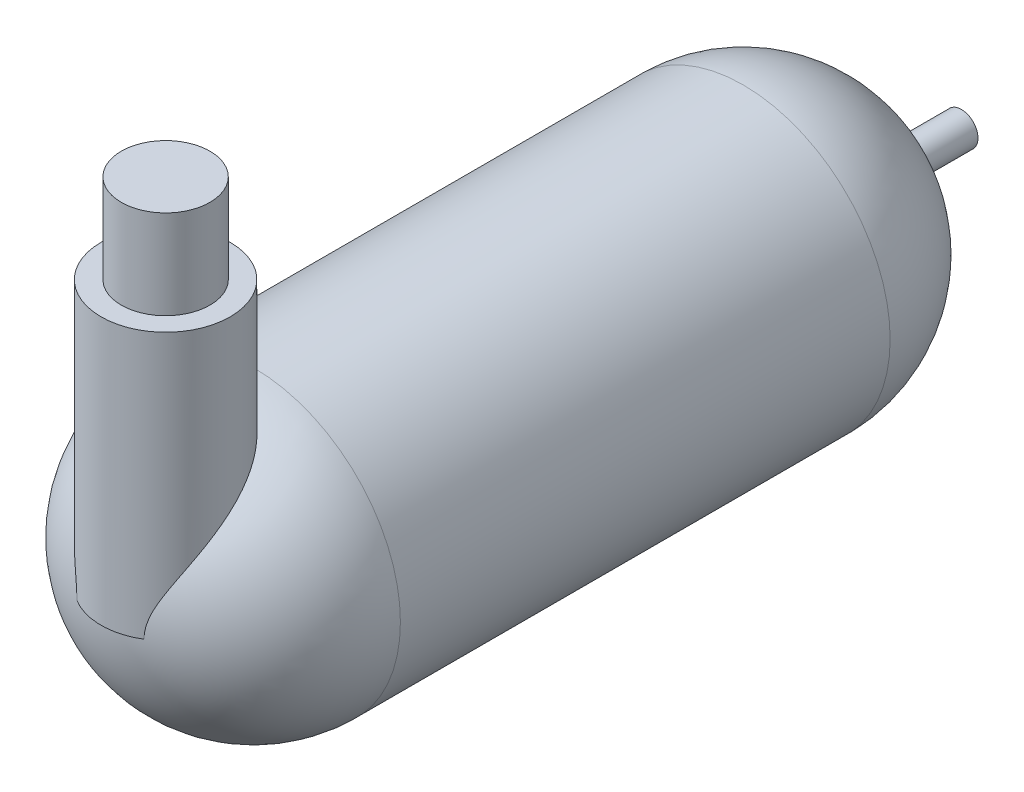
ISO-10303-21;
HEADER;
FILE_DESCRIPTION(('STEP AP214'),'2;1');
FILE_NAME('part.step','',(''),(''),'','','');
FILE_SCHEMA(('AUTOMOTIVE_DESIGN { 1 0 10303 214 1 1 1 1 }'));
ENDSEC;
DATA;
#1=APPLICATION_CONTEXT('core data for automotive mechanical design processes');
#2=APPLICATION_PROTOCOL_DEFINITION('international standard','automotive_design',2000,#1);
#3=PRODUCT_CONTEXT('',#1,'mechanical');
#4=PRODUCT('Part','Part','',(#3));
#5=PRODUCT_RELATED_PRODUCT_CATEGORY('part','',(#4));
#6=PRODUCT_DEFINITION_FORMATION('','',#4);
#7=PRODUCT_DEFINITION_CONTEXT('part definition',#1,'design');
#8=PRODUCT_DEFINITION('design','',#6,#7);
#9=PRODUCT_DEFINITION_SHAPE('','',#8);
#10=(LENGTH_UNIT() NAMED_UNIT(*) SI_UNIT(.MILLI.,.METRE.));
#11=(NAMED_UNIT(*) PLANE_ANGLE_UNIT() SI_UNIT($,.RADIAN.));
#12=(NAMED_UNIT(*) SI_UNIT($,.STERADIAN.) SOLID_ANGLE_UNIT());
#13=UNCERTAINTY_MEASURE_WITH_UNIT(LENGTH_MEASURE(1.E-05),#10,'distance_accuracy_value','');
#14=(GEOMETRIC_REPRESENTATION_CONTEXT(3) GLOBAL_UNCERTAINTY_ASSIGNED_CONTEXT((#13)) GLOBAL_UNIT_ASSIGNED_CONTEXT((#10,
#11,#12)) REPRESENTATION_CONTEXT('',''));
#15=CARTESIAN_POINT('',(0.,0.,0.));
#16=DIRECTION('',(0.,0.,1.));
#17=DIRECTION('',(1.,0.,0.));
#18=AXIS2_PLACEMENT_3D('',#15,#16,#17);
#19=CARTESIAN_POINT('',(0.,0.,-30.48));
#20=DIRECTION('',(0.,0.,1.));
#21=DIRECTION('',(1.,0.,0.));
#22=AXIS2_PLACEMENT_3D('',#19,#20,#21);
#23=PLANE('',#22);
#24=CARTESIAN_POINT('',(0.,0.,-30.48));
#25=DIRECTION('',(0.,0.,1.));
#26=DIRECTION('',(1.,0.,0.));
#27=AXIS2_PLACEMENT_3D('',#24,#25,#26);
#28=CIRCLE('',#27,25.4);
#29=CARTESIAN_POINT('',(25.4,0.,-30.48));
#30=VERTEX_POINT('',#29);
#31=EDGE_CURVE('E109',#30,#30,#28,.T.);
#32=ORIENTED_EDGE('',*,*,#31,.F.);
#33=EDGE_LOOP('',(#32));
#34=FACE_BOUND('',#33,.T.);
#35=CARTESIAN_POINT('',(0.,0.,-30.48));
#36=DIRECTION('',(0.,0.,1.));
#37=DIRECTION('',(1.,0.,0.));
#38=AXIS2_PLACEMENT_3D('',#35,#36,#37);
#39=CIRCLE('',#38,4.7371);
#40=CARTESIAN_POINT('',(4.7371,0.,-30.48));
#41=VERTEX_POINT('',#40);
#42=EDGE_CURVE('E11',#41,#41,#39,.F.);
#43=ORIENTED_EDGE('',*,*,#42,.F.);
#44=EDGE_LOOP('',(#43));
#45=FACE_BOUND('',#44,.T.);
#46=ADVANCED_FACE('F33',(#34,#45),#23,.F.);
#47=CARTESIAN_POINT('',(0.,76.2,164.769496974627));
#48=DIRECTION('',(0.,1.,0.));
#49=DIRECTION('',(0.,0.,1.));
#50=AXIS2_PLACEMENT_3D('',#47,#48,#49);
#51=PLANE('',#50);
#52=CARTESIAN_POINT('',(0.,76.2,164.769496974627));
#53=DIRECTION('',(0.,1.,0.));
#54=DIRECTION('',(0.,0.,1.));
#55=AXIS2_PLACEMENT_3D('',#52,#53,#54);
#56=CIRCLE('',#55,18.415);
#57=CARTESIAN_POINT('',(0.,76.2,183.184496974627));
#58=VERTEX_POINT('',#57);
#59=EDGE_CURVE('E59',#58,#58,#56,.T.);
#60=ORIENTED_EDGE('',*,*,#59,.T.);
#61=EDGE_LOOP('',(#60));
#62=FACE_BOUND('',#61,.T.);
#63=CARTESIAN_POINT('',(0.,76.2,164.769496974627));
#64=DIRECTION('',(0.,1.,0.));
#65=DIRECTION('',(0.,0.,1.));
#66=AXIS2_PLACEMENT_3D('',#63,#64,#65);
#67=CIRCLE('',#66,12.6476533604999);
#68=CARTESIAN_POINT('',(0.,76.2,177.417150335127));
#69=VERTEX_POINT('',#68);
#70=EDGE_CURVE('E116',#69,#69,#67,.T.);
#71=ORIENTED_EDGE('',*,*,#70,.F.);
#72=EDGE_LOOP('',(#71));
#73=FACE_BOUND('',#72,.T.);
#74=ADVANCED_FACE('F79',(#62,#73),#51,.T.);
#75=CARTESIAN_POINT('',(0.,0.,139.7));
#76=DIRECTION('',(0.,0.,-1.));
#77=DIRECTION('',(0.,1.,0.));
#78=AXIS2_PLACEMENT_3D('',#75,#76,#77);
#79=SPHERICAL_SURFACE('',#78,41.91);
#80=CARTESIAN_POINT('',(0.,0.,139.7));
#81=DIRECTION('',(0.,0.,1.));
#82=DIRECTION('',(1.,0.,0.));
#83=AXIS2_PLACEMENT_3D('',#80,#81,#82);
#84=CIRCLE('',#83,41.91);
#85=CARTESIAN_POINT('',(41.91,0.,139.7));
#86=VERTEX_POINT('',#85);
#87=EDGE_CURVE('E54',#86,#86,#84,.T.);
#88=ORIENTED_EDGE('',*,*,#87,.T.);
#89=EDGE_LOOP('',(#88));
#90=FACE_BOUND('',#89,.T.);
#91=CARTESIAN_POINT('',(0.,0.,139.7));
#92=DIRECTION('',(0.,1.,0.));
#93=DIRECTION('',(0.,0.,1.));
#94=AXIS2_PLACEMENT_3D('',#91,#92,#93);
#95=CIRCLE('',#94,41.91);
#96=CARTESIAN_POINT('',(9.56936559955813,0.,180.502883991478));
#97=VERTEX_POINT('',#96);
#98=CARTESIAN_POINT('',(-9.56936559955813,0.,180.502883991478));
#99=VERTEX_POINT('',#98);
#100=EDGE_CURVE('E50',#97,#99,#95,.F.);
#101=ORIENTED_EDGE('',*,*,#100,.T.);
#102=CARTESIAN_POINT('',(-9.56936560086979,-0.0002,180.50288399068));
#103=CARTESIAN_POINT('',(-9.56928423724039,0.267626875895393,180.502907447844));
#104=CARTESIAN_POINT('',(-9.57641319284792,0.535421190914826,180.498597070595));
#105=CARTESIAN_POINT('',(-9.60450601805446,1.06987708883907,180.48147252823));
#106=CARTESIAN_POINT('',(-9.62546275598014,1.3365391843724,180.468662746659));
#107=CARTESIAN_POINT('',(-9.68049088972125,1.86663432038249,180.434786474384));
#108=CARTESIAN_POINT('',(-9.7144972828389,2.13007679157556,180.413760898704));
#109=CARTESIAN_POINT('',(-9.79460172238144,2.65435026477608,180.363734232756));
#110=CARTESIAN_POINT('',(-9.84070114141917,2.91518096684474,180.334732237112));
#111=CARTESIAN_POINT('',(-9.99340912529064,3.68318524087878,180.237477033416));
#112=CARTESIAN_POINT('',(-10.1155636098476,4.18594332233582,180.158304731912));
#113=CARTESIAN_POINT('',(-10.3918770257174,5.17794321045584,179.973070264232));
#114=CARTESIAN_POINT('',(-10.5460815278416,5.66716463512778,179.866969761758));
#115=CARTESIAN_POINT('',(-10.8501679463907,6.55362026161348,179.649523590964));
#116=CARTESIAN_POINT('',(-10.9967053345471,6.95292040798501,179.541810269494));
#117=CARTESIAN_POINT('',(-11.3009635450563,7.74257187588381,179.310369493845));
#118=CARTESIAN_POINT('',(-11.4586867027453,8.13292130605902,179.186638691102));
#119=CARTESIAN_POINT('',(-11.7814820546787,8.90555618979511,178.924080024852));
#120=CARTESIAN_POINT('',(-11.9465568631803,9.28783870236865,178.785246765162));
#121=CARTESIAN_POINT('',(-12.2808366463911,10.0450121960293,178.493291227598));
#122=CARTESIAN_POINT('',(-12.4500413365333,10.4199036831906,178.340169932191));
#123=CARTESIAN_POINT('',(-12.7918155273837,11.1670574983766,178.018547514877));
#124=CARTESIAN_POINT('',(-12.9644016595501,11.5392487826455,177.849899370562));
#125=CARTESIAN_POINT('',(-13.308927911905,12.2775582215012,177.499190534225));
#126=CARTESIAN_POINT('',(-13.4808680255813,12.6436763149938,177.317129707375));
#127=CARTESIAN_POINT('',(-13.8221699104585,13.3702835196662,176.940137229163));
#128=CARTESIAN_POINT('',(-13.9915324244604,13.7307742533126,176.745209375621));
#129=CARTESIAN_POINT('',(-14.3261147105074,14.4466842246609,176.342877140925));
#130=CARTESIAN_POINT('',(-14.4913344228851,14.8021033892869,176.135472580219));
#131=CARTESIAN_POINT('',(-14.8374938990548,15.5544842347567,175.680638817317));
#132=CARTESIAN_POINT('',(-15.0176568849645,15.9507871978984,175.431526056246));
#133=CARTESIAN_POINT('',(-15.3690341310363,16.7377295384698,174.918472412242));
#134=CARTESIAN_POINT('',(-15.5402482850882,17.1283688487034,174.654531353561));
#135=CARTESIAN_POINT('',(-15.8721119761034,17.9043110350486,174.112372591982));
#136=CARTESIAN_POINT('',(-16.0327596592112,18.2896129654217,173.834152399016));
#137=CARTESIAN_POINT('',(-16.3419424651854,19.0549671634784,173.264100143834));
#138=CARTESIAN_POINT('',(-16.4904777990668,19.4350195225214,172.972268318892));
#139=CARTESIAN_POINT('',(-16.7735648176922,20.188731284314,172.376607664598));
#140=CARTESIAN_POINT('',(-16.9081605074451,20.5624074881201,172.072821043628));
#141=CARTESIAN_POINT('',(-17.1625856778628,21.3046126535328,171.453065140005));
#142=CARTESIAN_POINT('',(-17.2824161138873,21.6731419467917,171.137096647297));
#143=CARTESIAN_POINT('',(-17.5060243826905,22.4049301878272,170.493766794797));
#144=CARTESIAN_POINT('',(-17.609806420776,22.7681904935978,170.166408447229));
#145=CARTESIAN_POINT('',(-17.8001527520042,23.4894915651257,169.500946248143));
#146=CARTESIAN_POINT('',(-17.8867127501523,23.8475310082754,169.16283974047));
#147=CARTESIAN_POINT('',(-18.0946987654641,24.8030499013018,168.240348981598));
#148=CARTESIAN_POINT('',(-18.199052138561,25.3955241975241,167.64679468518));
#149=CARTESIAN_POINT('',(-18.3495515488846,26.5636495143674,166.436257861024));
#150=CARTESIAN_POINT('',(-18.3957085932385,27.1393036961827,165.819279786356));
#151=CARTESIAN_POINT('',(-18.4173293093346,27.9889195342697,164.880326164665));
#152=CARTESIAN_POINT('',(-18.4165977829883,28.2698431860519,164.565059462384));
#153=CARTESIAN_POINT('',(-18.3986271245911,28.8268074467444,163.930806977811));
#154=CARTESIAN_POINT('',(-18.3813905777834,29.1028488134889,163.61182178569));
#155=CARTESIAN_POINT('',(-18.3039608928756,29.9232734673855,162.650442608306));
#156=CARTESIAN_POINT('',(-18.2180534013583,30.4601472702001,162.003414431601));
#157=CARTESIAN_POINT('',(-17.9958528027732,31.4126832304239,160.82610293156));
#158=CARTESIAN_POINT('',(-17.8719733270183,31.8322501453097,160.296595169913));
#159=CARTESIAN_POINT('',(-17.5734438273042,32.6546640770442,159.23883427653));
#160=CARTESIAN_POINT('',(-17.3987965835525,33.0575120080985,158.710581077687));
#161=CARTESIAN_POINT('',(-16.9968282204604,33.8443656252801,157.660653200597));
#162=CARTESIAN_POINT('',(-16.7695513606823,34.228386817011,157.138973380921));
#163=CARTESIAN_POINT('',(-16.3880218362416,34.788799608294,156.365470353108));
#164=CARTESIAN_POINT('',(-16.254079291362,34.9729972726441,156.109143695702));
#165=CARTESIAN_POINT('',(-15.9724543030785,35.335997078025,155.600115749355));
#166=CARTESIAN_POINT('',(-15.8247683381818,35.5147978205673,155.347415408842));
#167=CARTESIAN_POINT('',(-15.4134149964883,35.9828909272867,154.681003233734));
#168=CARTESIAN_POINT('',(-15.1375712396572,36.2671596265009,154.271186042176));
#169=CARTESIAN_POINT('',(-14.5476154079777,36.8182813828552,153.467840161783));
#170=CARTESIAN_POINT('',(-14.2335102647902,37.085137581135,153.074308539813));
#171=CARTESIAN_POINT('',(-13.5672003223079,37.5999230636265,152.307504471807));
#172=CARTESIAN_POINT('',(-13.2149938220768,37.847851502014,151.934232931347));
#173=CARTESIAN_POINT('',(-12.4732805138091,38.3230527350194,151.212310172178));
#174=CARTESIAN_POINT('',(-12.0837730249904,38.5503251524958,150.863659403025));
#175=CARTESIAN_POINT('',(-11.2658171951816,38.9840530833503,150.192961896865));
#176=CARTESIAN_POINT('',(-10.8370978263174,39.1903390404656,149.87113514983));
#177=CARTESIAN_POINT('',(-9.94544483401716,39.5782698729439,149.261694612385));
#178=CARTESIAN_POINT('',(-9.48251018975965,39.7599140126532,148.974081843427));
#179=CARTESIAN_POINT('',(-8.52579635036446,40.0966107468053,148.437823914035));
#180=CARTESIAN_POINT('',(-8.03203632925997,40.2516796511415,148.189154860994));
#181=CARTESIAN_POINT('',(-7.01739381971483,40.5336060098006,147.734908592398));
#182=CARTESIAN_POINT('',(-6.49651613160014,40.6604684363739,147.529323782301));
#183=CARTESIAN_POINT('',(-5.5035754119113,40.8694844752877,147.189384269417));
#184=CARTESIAN_POINT('',(-5.03428463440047,40.9553464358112,147.049183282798));
#185=CARTESIAN_POINT('',(-4.08256942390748,41.1039129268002,146.806034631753));
#186=CARTESIAN_POINT('',(-3.60014622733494,41.1666196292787,146.70308347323));
#187=CARTESIAN_POINT('',(-2.62641851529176,41.2682047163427,146.53606486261));
#188=CARTESIAN_POINT('',(-2.13511908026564,41.3070963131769,146.471975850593));
#189=CARTESIAN_POINT('',(-1.1476474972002,41.36069077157,146.383611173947));
#190=CARTESIAN_POINT('',(-0.65147563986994,41.3753950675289,146.359333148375));
#191=CARTESIAN_POINT('',(0.295249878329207,41.3802282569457,146.351355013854));
#192=CARTESIAN_POINT('',(0.74576780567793,41.3725093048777,146.364101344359));
#193=CARTESIAN_POINT('',(1.64385030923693,41.3371099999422,146.422496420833));
#194=CARTESIAN_POINT('',(2.09141511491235,41.3094312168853,146.46814257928));
#195=CARTESIAN_POINT('',(2.9803092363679,41.2343630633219,146.591727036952));
#196=CARTESIAN_POINT('',(3.42163946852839,41.1869766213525,146.669660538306));
#197=CARTESIAN_POINT('',(4.29507022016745,41.0729006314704,146.856817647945));
#198=CARTESIAN_POINT('',(4.7271705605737,41.0062107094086,146.96604186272));
#199=CARTESIAN_POINT('',(5.57604415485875,40.8546595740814,147.213474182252));
#200=CARTESIAN_POINT('',(5.99290885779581,40.7699401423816,147.351455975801));
#201=CARTESIAN_POINT('',(6.81221344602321,40.5826962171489,147.655266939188));
#202=CARTESIAN_POINT('',(7.21465356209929,40.4801720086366,147.82109566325));
#203=CARTESIAN_POINT('',(8.0029553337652,40.2580550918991,148.178767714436));
#204=CARTESIAN_POINT('',(8.38881507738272,40.1384604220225,148.370614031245));
#205=CARTESIAN_POINT('',(9.14203402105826,39.8830260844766,148.778285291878));
#206=CARTESIAN_POINT('',(9.50939245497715,39.7471857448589,148.994111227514));
#207=CARTESIAN_POINT('',(10.2479606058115,39.4505095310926,149.462786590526));
#208=CARTESIAN_POINT('',(10.6177838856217,39.2886094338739,149.717146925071));
#209=CARTESIAN_POINT('',(11.3330911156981,38.9483583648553,150.24807508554));
#210=CARTESIAN_POINT('',(11.6785741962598,38.7700068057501,150.524643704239));
#211=CARTESIAN_POINT('',(12.3441582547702,38.3978776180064,151.097380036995));
#212=CARTESIAN_POINT('',(12.6642538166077,38.2040967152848,151.393551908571));
#213=CARTESIAN_POINT('',(13.2782493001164,37.8021656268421,152.002844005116));
#214=CARTESIAN_POINT('',(13.5721459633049,37.59401365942,152.315966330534));
#215=CARTESIAN_POINT('',(14.1681942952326,37.1376004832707,152.996487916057));
#216=CARTESIAN_POINT('',(14.4668200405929,36.8875717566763,153.365791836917));
#217=CARTESIAN_POINT('',(15.0300867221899,36.3719747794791,154.119145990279));
#218=CARTESIAN_POINT('',(15.2947252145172,36.1064054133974,154.503197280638));
#219=CARTESIAN_POINT('',(15.7902041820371,35.5609046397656,155.282921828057));
#220=CARTESIAN_POINT('',(16.021033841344,35.2809686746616,155.678598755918));
#221=CARTESIAN_POINT('',(16.4492232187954,34.7079534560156,156.478470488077));
#222=CARTESIAN_POINT('',(16.646579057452,34.4148726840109,156.882666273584));
#223=CARTESIAN_POINT('',(17.0385133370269,33.7669268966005,157.764419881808));
#224=CARTESIAN_POINT('',(17.2271833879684,33.4098865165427,158.243009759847));
#225=CARTESIAN_POINT('',(17.5611905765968,32.6809019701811,159.203923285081));
#226=CARTESIAN_POINT('',(17.7065235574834,32.3089563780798,159.686247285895));
#227=CARTESIAN_POINT('',(17.9554910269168,31.5513886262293,160.651137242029));
#228=CARTESIAN_POINT('',(18.0591117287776,31.1657619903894,161.133703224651));
#229=CARTESIAN_POINT('',(18.2263930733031,30.3820949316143,162.095691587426));
#230=CARTESIAN_POINT('',(18.2900488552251,29.984053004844,162.575113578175));
#231=CARTESIAN_POINT('',(18.3879333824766,29.098691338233,163.619778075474));
#232=CARTESIAN_POINT('',(18.4141180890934,28.6089599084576,164.183737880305));
#233=CARTESIAN_POINT('',(18.4158383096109,27.6147692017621,165.298584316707));
#234=CARTESIAN_POINT('',(18.3913681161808,27.1103082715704,165.849469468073));
#235=CARTESIAN_POINT('',(18.2954069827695,26.0877355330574,166.934433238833));
#236=CARTESIAN_POINT('',(18.2239033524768,25.5696200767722,167.468507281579));
#237=CARTESIAN_POINT('',(18.0376434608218,24.5207664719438,168.516347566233));
#238=CARTESIAN_POINT('',(17.9228822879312,23.9900268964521,169.030111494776));
#239=CARTESIAN_POINT('',(17.6261980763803,22.8056025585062,170.138175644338));
#240=CARTESIAN_POINT('',(17.4352947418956,22.1491861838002,170.727164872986));
#241=CARTESIAN_POINT('',(17.0033671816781,20.8196049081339,171.866616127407));
#242=CARTESIAN_POINT('',(16.7623348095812,20.1464373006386,172.417071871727));
#243=CARTESIAN_POINT('',(16.2375029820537,18.7824631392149,173.476114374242));
#244=CARTESIAN_POINT('',(15.9536480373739,18.0916346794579,173.98464546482));
#245=CARTESIAN_POINT('',(15.5025548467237,17.042386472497,174.712567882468));
#246=CARTESIAN_POINT('',(15.3479703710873,16.690466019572,174.949398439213));
#247=CARTESIAN_POINT('',(15.0315672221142,15.9820318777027,175.411041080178));
#248=CARTESIAN_POINT('',(14.8697489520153,15.6255184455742,175.635853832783));
#249=CARTESIAN_POINT('',(14.5422672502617,14.9121360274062,176.070282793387));
#250=CARTESIAN_POINT('',(14.3766775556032,14.555327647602,176.280054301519));
#251=CARTESIAN_POINT('',(14.0411669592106,13.8366411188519,176.687021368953));
#252=CARTESIAN_POINT('',(13.8712463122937,13.4747632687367,176.884217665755));
#253=CARTESIAN_POINT('',(13.5285954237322,12.7452836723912,177.26570013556));
#254=CARTESIAN_POINT('',(13.3558637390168,12.3776789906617,177.449979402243));
#255=CARTESIAN_POINT('',(13.0095656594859,11.6363859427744,177.805021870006));
#256=CARTESIAN_POINT('',(12.8359992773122,11.2626976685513,177.97578527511));
#257=CARTESIAN_POINT('',(12.4905012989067,10.5090905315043,178.303015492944));
#258=CARTESIAN_POINT('',(12.3185677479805,10.1291811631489,178.45950206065));
#259=CARTESIAN_POINT('',(11.9787461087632,9.3618032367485,178.757812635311));
#260=CARTESIAN_POINT('',(11.8108583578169,8.97433405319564,178.8996354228));
#261=CARTESIAN_POINT('',(11.48256063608,8.19137005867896,179.167687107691));
#262=CARTESIAN_POINT('',(11.3221436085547,7.79588334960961,179.293930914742));
#263=CARTESIAN_POINT('',(11.0126389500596,6.99574237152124,179.529980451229));
#264=CARTESIAN_POINT('',(10.8635484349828,6.59109047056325,179.639790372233));
#265=CARTESIAN_POINT('',(10.580390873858,5.76861383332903,179.842589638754));
#266=CARTESIAN_POINT('',(10.4464497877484,5.35071108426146,179.935441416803));
#267=CARTESIAN_POINT('',(10.2007625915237,4.50446465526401,180.101774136));
#268=CARTESIAN_POINT('',(10.0890188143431,4.07611988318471,180.175253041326));
#269=CARTESIAN_POINT('',(9.89463029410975,3.21202555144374,180.300816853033));
#270=CARTESIAN_POINT('',(9.8118394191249,2.77632516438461,180.353009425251));
#271=CARTESIAN_POINT('',(9.68059832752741,1.89785279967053,180.434884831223));
#272=CARTESIAN_POINT('',(9.63211721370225,1.45508755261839,180.46458791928));
#273=CARTESIAN_POINT('',(9.59169140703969,0.842677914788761,180.489286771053));
#274=CARTESIAN_POINT('',(9.5833367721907,0.674388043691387,180.494379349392));
#275=CARTESIAN_POINT('',(9.57216705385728,0.337340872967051,180.50118105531));
#276=CARTESIAN_POINT('',(9.56935907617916,0.168583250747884,180.502885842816));
#277=CARTESIAN_POINT('',(9.56936560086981,-0.000200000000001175,180.50288399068));
#278=B_SPLINE_CURVE_WITH_KNOTS('',3,(#102,#103,#104,#105,#106,#107,#108,#109,#110,#111,#112,
#113,#114,#115,#116,#117,#118,#119,#120,#121,#122,#123,#124,#125,#126,#127,#128,#129,#130,#131,
#132,#133,#134,#135,#136,#137,#138,#139,#140,#141,#142,#143,#144,#145,#146,#147,#148,#149,#150,
#151,#152,#153,#154,#155,#156,#157,#158,#159,#160,#161,#162,#163,#164,#165,#166,#167,#168,#169,
#170,#171,#172,#173,#174,#175,#176,#177,#178,#179,#180,#181,#182,#183,#184,#185,#186,#187,#188,
#189,#190,#191,#192,#193,#194,#195,#196,#197,#198,#199,#200,#201,#202,#203,#204,#205,#206,#207,
#208,#209,#210,#211,#212,#213,#214,#215,#216,#217,#218,#219,#220,#221,#222,#223,#224,#225,#226,
#227,#228,#229,#230,#231,#232,#233,#234,#235,#236,#237,#238,#239,#240,#241,#242,#243,#244,#245,
#246,#247,#248,#249,#250,#251,#252,#253,#254,#255,#256,#257,#258,#259,#260,#261,#262,#263,#264,
#265,#266,#267,#268,#269,#270,#271,#272,#273,#274,#275,#276,#277),.UNSPECIFIED.,.F.,.F.,(4,2,2,
2,2,2,2,2,2,2,2,2,2,2,2,2,2,2,2,2,2,2,2,2,2,2,2,2,2,2,2,2,2,2,2,2,2,2,2,2,2,2,2,2,2,2,2,2,2,2,2,
2,2,2,2,2,2,2,2,2,2,2,2,2,2,2,2,2,2,2,2,2,2,2,2,2,2,2,2,2,2,2,2,2,2,2,2,4),(0.,
0.803297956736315,1.60618193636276,2.40511745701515,3.2041436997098,4.77187422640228,
6.34184929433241,7.65756257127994,8.97355135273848,10.2900118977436,11.6063819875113,
12.9368360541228,14.26730349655,15.5973799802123,16.9274756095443,18.4318508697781,
19.9362439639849,21.4409002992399,22.9455304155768,24.4452557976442,25.9448840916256,
27.4441187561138,28.9437268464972,31.4766267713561,34.0090475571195,35.2755286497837,
36.5418114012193,39.0735285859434,41.1322006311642,43.1907599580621,45.2475943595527,
46.275971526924,47.304612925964,49.0126697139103,50.720417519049,52.4282415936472,
54.1360968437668,55.8568064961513,57.5775675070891,59.2972686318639,61.0166663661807,
62.5064140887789,63.9960220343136,65.4848028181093,66.9734953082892,68.3241605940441,
69.6747196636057,71.0250781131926,72.375462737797,73.7155965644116,75.0557089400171,
76.3959754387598,77.7362973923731,79.1662849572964,80.5963235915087,82.026666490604,
83.4571870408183,85.0657677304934,86.6744640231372,88.2836738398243,89.8930700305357,
91.7698380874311,93.6467861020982,95.5243539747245,97.4021501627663,99.6421351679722,
101.882372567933,104.12321466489,106.364311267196,109.06876721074,111.77366299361,
114.482094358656,115.836336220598,117.190502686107,118.527675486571,119.864769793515,
121.202573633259,122.540357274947,123.876260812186,125.212275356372,126.547001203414,
127.881386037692,129.226156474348,130.571068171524,131.909090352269,133.245906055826,
133.751526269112,134.257793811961),.UNSPECIFIED.);
#279=EDGE_CURVE('E41',#99,#97,#278,.T.);
#280=ORIENTED_EDGE('',*,*,#279,.T.);
#281=EDGE_LOOP('',(#101,#280));
#282=FACE_BOUND('',#281,.T.);
#283=ADVANCED_FACE('F62',(#90,#282),#79,.T.);
#284=CARTESIAN_POINT('',(0.,0.,139.7));
#285=DIRECTION('',(0.,0.,-1.));
#286=DIRECTION('',(-1.,0.,0.));
#287=AXIS2_PLACEMENT_3D('',#284,#285,#286);
#288=CYLINDRICAL_SURFACE('',#287,41.91);
#289=ORIENTED_EDGE('',*,*,#87,.F.);
#290=EDGE_LOOP('',(#289));
#291=FACE_BOUND('',#290,.T.);
#292=CARTESIAN_POINT('',(0.,0.,0.));
#293=DIRECTION('',(0.,0.,-1.));
#294=DIRECTION('',(-1.,0.,0.));
#295=AXIS2_PLACEMENT_3D('',#292,#293,#294);
#296=CIRCLE('',#295,41.91);
#297=CARTESIAN_POINT('',(-41.91,0.,0.));
#298=VERTEX_POINT('',#297);
#299=EDGE_CURVE('E120',#298,#298,#296,.T.);
#300=ORIENTED_EDGE('',*,*,#299,.F.);
#301=EDGE_LOOP('',(#300));
#302=FACE_BOUND('',#301,.T.);
#303=ADVANCED_FACE('F35',(#291,#302),#288,.T.);
#304=CARTESIAN_POINT('',(0.,0.,0.));
#305=DIRECTION('',(0.,0.,-1.));
#306=DIRECTION('',(0.,1.,0.));
#307=AXIS2_PLACEMENT_3D('',#304,#305,#306);
#308=SPHERICAL_SURFACE('',#307,41.91);
#309=CARTESIAN_POINT('',(0.,0.,-33.335988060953));
#310=DIRECTION('',(0.,0.,1.));
#311=DIRECTION('',(1.,0.,0.));
#312=AXIS2_PLACEMENT_3D('',#309,#310,#311);
#313=CIRCLE('',#312,25.4);
#314=CARTESIAN_POINT('',(25.4,0.,-33.335988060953));
#315=VERTEX_POINT('',#314);
#316=EDGE_CURVE('E70',#315,#315,#313,.F.);
#317=ORIENTED_EDGE('',*,*,#316,.F.);
#318=EDGE_LOOP('',(#317));
#319=FACE_BOUND('',#318,.T.);
#320=ORIENTED_EDGE('',*,*,#299,.T.);
#321=EDGE_LOOP('',(#320));
#322=FACE_BOUND('',#321,.T.);
#323=ADVANCED_FACE('F75',(#319,#322),#308,.T.);
#324=CARTESIAN_POINT('',(0.,76.2,164.769496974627));
#325=DIRECTION('',(0.,-1.,0.));
#326=DIRECTION('',(0.,0.,-1.));
#327=AXIS2_PLACEMENT_3D('',#324,#325,#326);
#328=CYLINDRICAL_SURFACE('',#327,18.415);
#329=ORIENTED_EDGE('',*,*,#279,.F.);
#330=CARTESIAN_POINT('',(0.,0.,164.769496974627));
#331=DIRECTION('',(0.,1.,0.));
#332=DIRECTION('',(0.,0.,1.));
#333=AXIS2_PLACEMENT_3D('',#330,#331,#332);
#334=CIRCLE('',#333,18.415);
#335=EDGE_CURVE('E47',#99,#97,#334,.T.);
#336=ORIENTED_EDGE('',*,*,#335,.T.);
#337=EDGE_LOOP('',(#329,#336));
#338=FACE_BOUND('',#337,.T.);
#339=ORIENTED_EDGE('',*,*,#59,.F.);
#340=EDGE_LOOP('',(#339));
#341=FACE_BOUND('',#340,.T.);
#342=ADVANCED_FACE('F57',(#338,#341),#328,.T.);
#343=CARTESIAN_POINT('',(0.,0.,164.769496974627));
#344=DIRECTION('',(0.,1.,0.));
#345=DIRECTION('',(0.,0.,1.));
#346=AXIS2_PLACEMENT_3D('',#343,#344,#345);
#347=PLANE('',#346);
#348=ORIENTED_EDGE('',*,*,#100,.F.);
#349=ORIENTED_EDGE('',*,*,#335,.F.);
#350=EDGE_LOOP('',(#348,#349));
#351=FACE_BOUND('',#350,.T.);
#352=ADVANCED_FACE('F51',(#351),#347,.F.);
#353=CARTESIAN_POINT('',(0.,101.6,164.769496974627));
#354=DIRECTION('',(0.,-1.,0.));
#355=DIRECTION('',(0.,0.,-1.));
#356=AXIS2_PLACEMENT_3D('',#353,#354,#355);
#357=CYLINDRICAL_SURFACE('',#356,12.6476533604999);
#358=CARTESIAN_POINT('',(0.,101.6,164.769496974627));
#359=DIRECTION('',(0.,1.,0.));
#360=DIRECTION('',(0.,0.,1.));
#361=AXIS2_PLACEMENT_3D('',#358,#359,#360);
#362=CIRCLE('',#361,12.6476533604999);
#363=CARTESIAN_POINT('',(0.,101.6,177.417150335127));
#364=VERTEX_POINT('',#363);
#365=EDGE_CURVE('E60',#364,#364,#362,.T.);
#366=ORIENTED_EDGE('',*,*,#365,.F.);
#367=EDGE_LOOP('',(#366));
#368=FACE_BOUND('',#367,.T.);
#369=ORIENTED_EDGE('',*,*,#70,.T.);
#370=EDGE_LOOP('',(#369));
#371=FACE_BOUND('',#370,.T.);
#372=ADVANCED_FACE('F78',(#368,#371),#357,.T.);
#373=CARTESIAN_POINT('',(0.,101.6,164.769496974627));
#374=DIRECTION('',(0.,1.,0.));
#375=DIRECTION('',(0.,0.,1.));
#376=AXIS2_PLACEMENT_3D('',#373,#374,#375);
#377=PLANE('',#376);
#378=ORIENTED_EDGE('',*,*,#365,.T.);
#379=EDGE_LOOP('',(#378));
#380=FACE_BOUND('',#379,.T.);
#381=ADVANCED_FACE('F85',(#380),#377,.T.);
#382=CARTESIAN_POINT('',(0.,0.,-55.88));
#383=DIRECTION('',(0.,0.,1.));
#384=DIRECTION('',(1.,0.,0.));
#385=AXIS2_PLACEMENT_3D('',#382,#383,#384);
#386=CYLINDRICAL_SURFACE('',#385,25.4);
#387=ORIENTED_EDGE('',*,*,#316,.T.);
#388=EDGE_LOOP('',(#387));
#389=FACE_BOUND('',#388,.T.);
#390=ORIENTED_EDGE('',*,*,#31,.T.);
#391=EDGE_LOOP('',(#390));
#392=FACE_BOUND('',#391,.T.);
#393=ADVANCED_FACE('F89',(#389,#392),#386,.F.);
#394=CARTESIAN_POINT('',(0.,0.,-62.23));
#395=DIRECTION('',(0.,0.,1.));
#396=DIRECTION('',(1.,0.,0.));
#397=AXIS2_PLACEMENT_3D('',#394,#395,#396);
#398=CYLINDRICAL_SURFACE('',#397,4.7371);
#399=CARTESIAN_POINT('',(0.,0.,-62.23));
#400=DIRECTION('',(0.,0.,-1.));
#401=DIRECTION('',(-1.,0.,0.));
#402=AXIS2_PLACEMENT_3D('',#399,#400,#401);
#403=CIRCLE('',#402,4.7371);
#404=CARTESIAN_POINT('',(-4.7371,0.,-62.23));
#405=VERTEX_POINT('',#404);
#406=EDGE_CURVE('E108',#405,#405,#403,.T.);
#407=ORIENTED_EDGE('',*,*,#406,.F.);
#408=EDGE_LOOP('',(#407));
#409=FACE_BOUND('',#408,.T.);
#410=ORIENTED_EDGE('',*,*,#42,.T.);
#411=EDGE_LOOP('',(#410));
#412=FACE_BOUND('',#411,.T.);
#413=ADVANCED_FACE('F93',(#409,#412),#398,.T.);
#414=CARTESIAN_POINT('',(0.,0.,-62.23));
#415=DIRECTION('',(0.,0.,-1.));
#416=DIRECTION('',(-1.,0.,0.));
#417=AXIS2_PLACEMENT_3D('',#414,#415,#416);
#418=PLANE('',#417);
#419=ORIENTED_EDGE('',*,*,#406,.T.);
#420=EDGE_LOOP('',(#419));
#421=FACE_BOUND('',#420,.T.);
#422=ADVANCED_FACE('F100',(#421),#418,.T.);
#423=CLOSED_SHELL('',(#46,#74,#283,#303,#323,#342,#352,#372,#381,#393,#413,#422));
#424=MANIFOLD_SOLID_BREP('B2',#423);
#425=ADVANCED_BREP_SHAPE_REPRESENTATION('',(#18,#424),#14);
#426=SHAPE_DEFINITION_REPRESENTATION(#9,#425);
ENDSEC;
END-ISO-10303-21;
